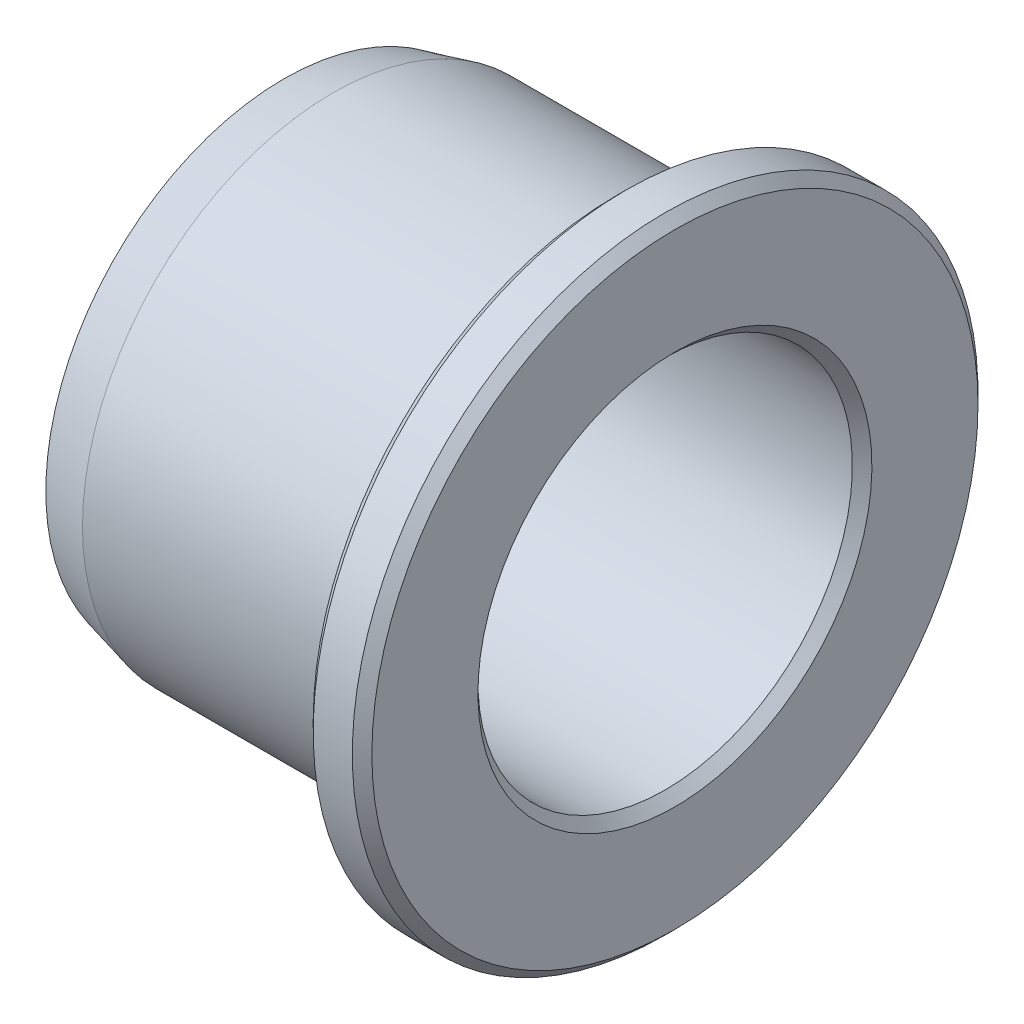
ISO-10303-21;
HEADER;
FILE_DESCRIPTION(('STEP AP214'),'2;1');
FILE_NAME('part.step','',(''),(''),'','','');
FILE_SCHEMA(('AUTOMOTIVE_DESIGN { 1 0 10303 214 1 1 1 1 }'));
ENDSEC;
DATA;
#1=APPLICATION_CONTEXT('core data for automotive mechanical design processes');
#2=APPLICATION_PROTOCOL_DEFINITION('international standard','automotive_design',2000,#1);
#3=PRODUCT_CONTEXT('',#1,'mechanical');
#4=PRODUCT('Part','Part','',(#3));
#5=PRODUCT_RELATED_PRODUCT_CATEGORY('part','',(#4));
#6=PRODUCT_DEFINITION_FORMATION('','',#4);
#7=PRODUCT_DEFINITION_CONTEXT('part definition',#1,'design');
#8=PRODUCT_DEFINITION('design','',#6,#7);
#9=PRODUCT_DEFINITION_SHAPE('','',#8);
#10=(LENGTH_UNIT() NAMED_UNIT(*) SI_UNIT(.MILLI.,.METRE.));
#11=(NAMED_UNIT(*) PLANE_ANGLE_UNIT() SI_UNIT($,.RADIAN.));
#12=(NAMED_UNIT(*) SI_UNIT($,.STERADIAN.) SOLID_ANGLE_UNIT());
#13=UNCERTAINTY_MEASURE_WITH_UNIT(LENGTH_MEASURE(1.E-05),#10,'distance_accuracy_value','');
#14=(GEOMETRIC_REPRESENTATION_CONTEXT(3) GLOBAL_UNCERTAINTY_ASSIGNED_CONTEXT((#13)) GLOBAL_UNIT_ASSIGNED_CONTEXT((#10,
#11,#12)) REPRESENTATION_CONTEXT('',''));
#15=CARTESIAN_POINT('',(0.,0.,0.));
#16=DIRECTION('',(0.,0.,1.));
#17=DIRECTION('',(1.,0.,0.));
#18=AXIS2_PLACEMENT_3D('',#15,#16,#17);
#19=CARTESIAN_POINT('',(290.27808520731,156.352836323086,0.));
#20=DIRECTION('',(1.,0.,0.));
#21=DIRECTION('',(0.,1.,0.));
#22=AXIS2_PLACEMENT_3D('',#19,#20,#21);
#23=CYLINDRICAL_SURFACE('',#22,9.575);
#24=CARTESIAN_POINT('',(287.27808520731,156.352836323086,0.));
#25=DIRECTION('',(1.,0.,0.));
#26=DIRECTION('',(0.,1.,0.));
#27=AXIS2_PLACEMENT_3D('',#24,#25,#26);
#28=CIRCLE('',#27,9.575);
#29=CARTESIAN_POINT('',(287.27808520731,165.927836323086,0.));
#30=VERTEX_POINT('',#29);
#31=EDGE_CURVE('E10',#30,#30,#28,.T.);
#32=ORIENTED_EDGE('',*,*,#31,.T.);
#33=EDGE_LOOP('',(#32));
#34=FACE_BOUND('',#33,.T.);
#35=CARTESIAN_POINT('',(268.27808520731,156.352836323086,0.));
#36=DIRECTION('',(1.,0.,0.));
#37=DIRECTION('',(0.,1.,0.));
#38=AXIS2_PLACEMENT_3D('',#35,#36,#37);
#39=CIRCLE('',#38,9.575);
#40=CARTESIAN_POINT('',(268.27808520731,165.927836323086,0.));
#41=VERTEX_POINT('',#40);
#42=EDGE_CURVE('E51',#41,#41,#39,.T.);
#43=ORIENTED_EDGE('',*,*,#42,.F.);
#44=EDGE_LOOP('',(#43));
#45=FACE_BOUND('',#44,.T.);
#46=ADVANCED_FACE('F14',(#34,#45),#23,.F.);
#47=CARTESIAN_POINT('',(287.27808520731,156.352836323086,0.));
#48=DIRECTION('',(1.,0.,0.));
#49=DIRECTION('',(0.,1.,0.));
#50=AXIS2_PLACEMENT_3D('',#47,#48,#49);
#51=CONICAL_SURFACE('',#50,9.575,0.785398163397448);
#52=CARTESIAN_POINT('',(287.77808520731,156.352836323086,0.));
#53=DIRECTION('',(1.,0.,0.));
#54=DIRECTION('',(0.,1.,0.));
#55=AXIS2_PLACEMENT_3D('',#52,#53,#54);
#56=CIRCLE('',#55,10.075);
#57=CARTESIAN_POINT('',(287.77808520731,166.427836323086,0.));
#58=VERTEX_POINT('',#57);
#59=EDGE_CURVE('E20',#58,#58,#56,.T.);
#60=ORIENTED_EDGE('',*,*,#59,.T.);
#61=EDGE_LOOP('',(#60));
#62=FACE_BOUND('',#61,.T.);
#63=ORIENTED_EDGE('',*,*,#31,.F.);
#64=EDGE_LOOP('',(#63));
#65=FACE_BOUND('',#64,.T.);
#66=ADVANCED_FACE('F59',(#62,#65),#51,.F.);
#67=CARTESIAN_POINT('',(287.77808520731,171.852836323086,0.));
#68=DIRECTION('',(1.,0.,0.));
#69=DIRECTION('',(0.,1.,0.));
#70=AXIS2_PLACEMENT_3D('',#67,#68,#69);
#71=PLANE('',#70);
#72=CARTESIAN_POINT('',(287.77808520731,156.352836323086,0.));
#73=DIRECTION('',(1.,0.,0.));
#74=DIRECTION('',(0.,1.,0.));
#75=AXIS2_PLACEMENT_3D('',#72,#73,#74);
#76=CIRCLE('',#75,15.5);
#77=CARTESIAN_POINT('',(287.77808520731,171.852836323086,0.));
#78=VERTEX_POINT('',#77);
#79=EDGE_CURVE('E24',#78,#78,#76,.T.);
#80=ORIENTED_EDGE('',*,*,#79,.T.);
#81=EDGE_LOOP('',(#80));
#82=FACE_BOUND('',#81,.T.);
#83=ORIENTED_EDGE('',*,*,#59,.F.);
#84=EDGE_LOOP('',(#83));
#85=FACE_BOUND('',#84,.T.);
#86=ADVANCED_FACE('F64',(#82,#85),#71,.T.);
#87=CARTESIAN_POINT('',(287.77808520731,156.352836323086,0.));
#88=DIRECTION('',(-1.,0.,0.));
#89=DIRECTION('',(0.,-1.,0.));
#90=AXIS2_PLACEMENT_3D('',#87,#88,#89);
#91=CONICAL_SURFACE('',#90,15.5,0.785398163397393);
#92=CARTESIAN_POINT('',(287.27808520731,156.352836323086,0.));
#93=DIRECTION('',(1.,0.,0.));
#94=DIRECTION('',(0.,1.,0.));
#95=AXIS2_PLACEMENT_3D('',#92,#93,#94);
#96=CIRCLE('',#95,16.);
#97=CARTESIAN_POINT('',(287.27808520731,172.352836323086,0.));
#98=VERTEX_POINT('',#97);
#99=EDGE_CURVE('E28',#98,#98,#96,.T.);
#100=ORIENTED_EDGE('',*,*,#99,.T.);
#101=EDGE_LOOP('',(#100));
#102=FACE_BOUND('',#101,.T.);
#103=ORIENTED_EDGE('',*,*,#79,.F.);
#104=EDGE_LOOP('',(#103));
#105=FACE_BOUND('',#104,.T.);
#106=ADVANCED_FACE('F68',(#102,#105),#91,.T.);
#107=CARTESIAN_POINT('',(290.27808520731,156.352836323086,0.));
#108=DIRECTION('',(1.,0.,0.));
#109=DIRECTION('',(0.,1.,0.));
#110=AXIS2_PLACEMENT_3D('',#107,#108,#109);
#111=CYLINDRICAL_SURFACE('',#110,16.);
#112=CARTESIAN_POINT('',(285.27808520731,156.352836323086,0.));
#113=DIRECTION('',(1.,0.,0.));
#114=DIRECTION('',(0.,1.,0.));
#115=AXIS2_PLACEMENT_3D('',#112,#113,#114);
#116=CIRCLE('',#115,16.);
#117=CARTESIAN_POINT('',(285.27808520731,172.352836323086,0.));
#118=VERTEX_POINT('',#117);
#119=EDGE_CURVE('E33',#118,#118,#116,.T.);
#120=ORIENTED_EDGE('',*,*,#119,.T.);
#121=EDGE_LOOP('',(#120));
#122=FACE_BOUND('',#121,.T.);
#123=ORIENTED_EDGE('',*,*,#99,.F.);
#124=EDGE_LOOP('',(#123));
#125=FACE_BOUND('',#124,.T.);
#126=ADVANCED_FACE('F75',(#122,#125),#111,.T.);
#127=CARTESIAN_POINT('',(285.27808520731,156.352836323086,0.));
#128=DIRECTION('',(1.,0.,0.));
#129=DIRECTION('',(0.,1.,0.));
#130=AXIS2_PLACEMENT_3D('',#127,#128,#129);
#131=CONICAL_SURFACE('',#130,16.,0.785398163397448);
#132=CARTESIAN_POINT('',(284.77808520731,156.352836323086,0.));
#133=DIRECTION('',(1.,0.,0.));
#134=DIRECTION('',(0.,1.,0.));
#135=AXIS2_PLACEMENT_3D('',#132,#133,#134);
#136=CIRCLE('',#135,15.5);
#137=CARTESIAN_POINT('',(284.77808520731,171.852836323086,0.));
#138=VERTEX_POINT('',#137);
#139=EDGE_CURVE('E36',#138,#138,#136,.T.);
#140=ORIENTED_EDGE('',*,*,#139,.T.);
#141=EDGE_LOOP('',(#140));
#142=FACE_BOUND('',#141,.T.);
#143=ORIENTED_EDGE('',*,*,#119,.F.);
#144=EDGE_LOOP('',(#143));
#145=FACE_BOUND('',#144,.T.);
#146=ADVANCED_FACE('F79',(#142,#145),#131,.T.);
#147=CARTESIAN_POINT('',(284.77808520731,169.152836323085,0.));
#148=DIRECTION('',(-1.,0.,0.));
#149=DIRECTION('',(0.,-1.,0.));
#150=AXIS2_PLACEMENT_3D('',#147,#148,#149);
#151=PLANE('',#150);
#152=CARTESIAN_POINT('',(284.77808520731,156.352836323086,0.));
#153=DIRECTION('',(1.,0.,0.));
#154=DIRECTION('',(0.,1.,0.));
#155=AXIS2_PLACEMENT_3D('',#152,#153,#154);
#156=CIRCLE('',#155,12.8);
#157=CARTESIAN_POINT('',(284.77808520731,169.152836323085,0.));
#158=VERTEX_POINT('',#157);
#159=EDGE_CURVE('E39',#158,#158,#156,.T.);
#160=ORIENTED_EDGE('',*,*,#159,.T.);
#161=EDGE_LOOP('',(#160));
#162=FACE_BOUND('',#161,.T.);
#163=ORIENTED_EDGE('',*,*,#139,.F.);
#164=EDGE_LOOP('',(#163));
#165=FACE_BOUND('',#164,.T.);
#166=ADVANCED_FACE('F83',(#162,#165),#151,.T.);
#167=CARTESIAN_POINT('',(290.27808520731,156.352836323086,0.));
#168=DIRECTION('',(1.,0.,0.));
#169=DIRECTION('',(0.,1.,0.));
#170=AXIS2_PLACEMENT_3D('',#167,#168,#169);
#171=CYLINDRICAL_SURFACE('',#170,12.8);
#172=CARTESIAN_POINT('',(270.27808520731,156.352836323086,0.));
#173=DIRECTION('',(1.,0.,0.));
#174=DIRECTION('',(0.,1.,0.));
#175=AXIS2_PLACEMENT_3D('',#172,#173,#174);
#176=CIRCLE('',#175,12.8);
#177=CARTESIAN_POINT('',(270.27808520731,169.152836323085,0.));
#178=VERTEX_POINT('',#177);
#179=EDGE_CURVE('E42',#178,#178,#176,.T.);
#180=ORIENTED_EDGE('',*,*,#179,.T.);
#181=EDGE_LOOP('',(#180));
#182=FACE_BOUND('',#181,.T.);
#183=ORIENTED_EDGE('',*,*,#159,.F.);
#184=EDGE_LOOP('',(#183));
#185=FACE_BOUND('',#184,.T.);
#186=ADVANCED_FACE('F87',(#182,#185),#171,.T.);
#187=CARTESIAN_POINT('',(270.27808520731,156.352836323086,0.));
#188=DIRECTION('',(1.,0.,0.));
#189=DIRECTION('',(0.,1.,0.));
#190=AXIS2_PLACEMENT_3D('',#187,#188,#189);
#191=CONICAL_SURFACE('',#190,12.8,0.244978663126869);
#192=CARTESIAN_POINT('',(267.77808520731,156.352836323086,0.));
#193=DIRECTION('',(1.,0.,0.));
#194=DIRECTION('',(0.,1.,0.));
#195=AXIS2_PLACEMENT_3D('',#192,#193,#194);
#196=CIRCLE('',#195,12.175);
#197=CARTESIAN_POINT('',(267.77808520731,168.527836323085,0.));
#198=VERTEX_POINT('',#197);
#199=EDGE_CURVE('E45',#198,#198,#196,.T.);
#200=ORIENTED_EDGE('',*,*,#199,.T.);
#201=EDGE_LOOP('',(#200));
#202=FACE_BOUND('',#201,.T.);
#203=ORIENTED_EDGE('',*,*,#179,.F.);
#204=EDGE_LOOP('',(#203));
#205=FACE_BOUND('',#204,.T.);
#206=ADVANCED_FACE('F91',(#202,#205),#191,.T.);
#207=CARTESIAN_POINT('',(267.77808520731,168.527836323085,0.));
#208=DIRECTION('',(-1.,0.,0.));
#209=DIRECTION('',(0.,-1.,0.));
#210=AXIS2_PLACEMENT_3D('',#207,#208,#209);
#211=PLANE('',#210);
#212=CARTESIAN_POINT('',(267.77808520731,156.352836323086,0.));
#213=DIRECTION('',(1.,0.,0.));
#214=DIRECTION('',(0.,1.,0.));
#215=AXIS2_PLACEMENT_3D('',#212,#213,#214);
#216=CIRCLE('',#215,10.075);
#217=CARTESIAN_POINT('',(267.77808520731,166.427836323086,0.));
#218=VERTEX_POINT('',#217);
#219=EDGE_CURVE('E48',#218,#218,#216,.T.);
#220=ORIENTED_EDGE('',*,*,#219,.T.);
#221=EDGE_LOOP('',(#220));
#222=FACE_BOUND('',#221,.T.);
#223=ORIENTED_EDGE('',*,*,#199,.F.);
#224=EDGE_LOOP('',(#223));
#225=FACE_BOUND('',#224,.T.);
#226=ADVANCED_FACE('F95',(#222,#225),#211,.T.);
#227=CARTESIAN_POINT('',(267.77808520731,156.352836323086,0.));
#228=DIRECTION('',(-1.,0.,0.));
#229=DIRECTION('',(0.,-1.,0.));
#230=AXIS2_PLACEMENT_3D('',#227,#228,#229);
#231=CONICAL_SURFACE('',#230,10.075,0.785398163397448);
#232=ORIENTED_EDGE('',*,*,#42,.T.);
#233=EDGE_LOOP('',(#232));
#234=FACE_BOUND('',#233,.T.);
#235=ORIENTED_EDGE('',*,*,#219,.F.);
#236=EDGE_LOOP('',(#235));
#237=FACE_BOUND('',#236,.T.);
#238=ADVANCED_FACE('F55',(#234,#237),#231,.F.);
#239=CLOSED_SHELL('',(#46,#66,#86,#106,#126,#146,#166,#186,#206,#226,#238));
#240=MANIFOLD_SOLID_BREP('B1',#239);
#241=ADVANCED_BREP_SHAPE_REPRESENTATION('',(#18,#240),#14);
#242=SHAPE_DEFINITION_REPRESENTATION(#9,#241);
ENDSEC;
END-ISO-10303-21;
